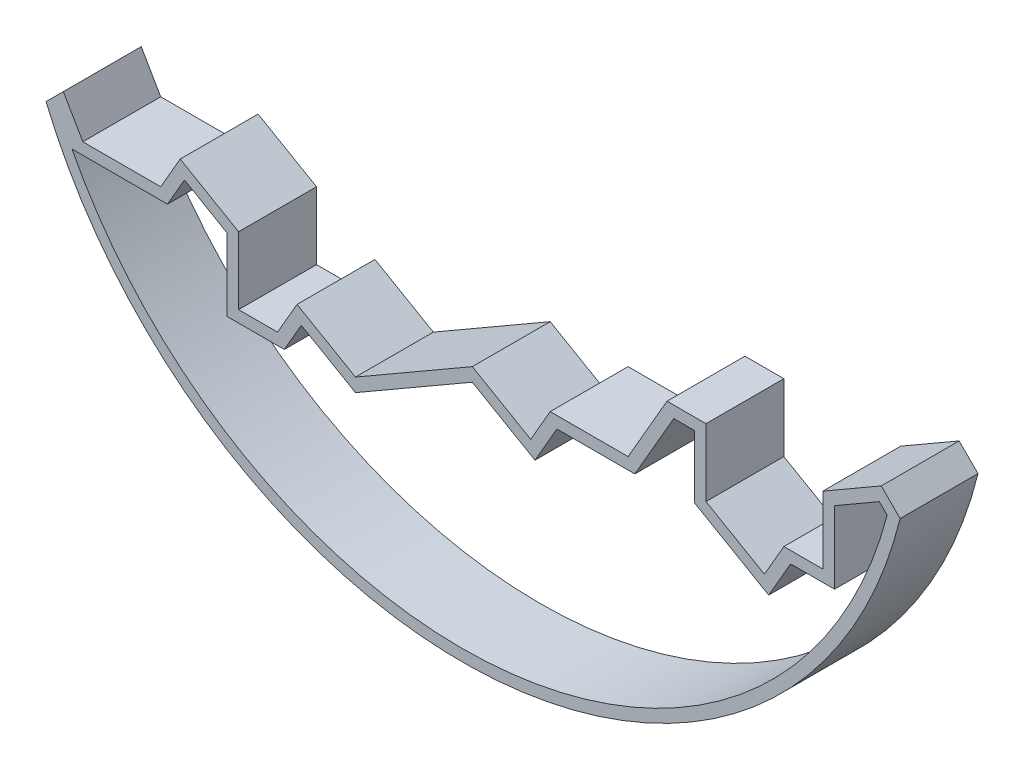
from build123d import *

# Parameters (mm, degrees)
P_IDAT_VYSUNUT_M1_DEPTH = 20


with BuildPart() as part:
    # Skica1 → P_idat vysunut_m1 (new body)
    with BuildSketch(Plane.XY):
        with BuildLine():
            Line((-181.460670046, 28.810119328), (-176.460670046, 20.14986529))
            Line((-176.460670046, 20.14986529), (-156.460670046, 20.14986529))
            Line((-156.460670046, 20.14986529), (-151.460670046, 28.810119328))
            Line((-151.460670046, 28.810119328), (-136.460670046, 20.14986529))
            Line((-136.460670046, 20.14986529), (-136.460670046, 2.829357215))
            Line((-136.460670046, 2.829357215), (-126.460670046, 2.829357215))
            Line((-126.460670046, 2.829357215), (-121.460670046, 11.489611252))
            Line((-121.460670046, 11.489611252), (-106.460670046, 2.829357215))
            Line((-106.460670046, 2.829357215), (-76.460670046, 20.14986529))
            Line((-76.460670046, 20.14986529), (-61.460670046, 11.489611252))
            Line((-61.460670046, 11.489611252), (-56.460670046, 20.14986529))
            Line((-56.460670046, 20.14986529), (-36.460670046, 20.14986529))
            Line((-36.460670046, 20.14986529), (-26.460670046, 37.470373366))
            Line((-26.460670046, 37.470373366), (-16.460670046, 37.470373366))
            Line((-16.460670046, 37.470373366), (-16.460670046, 20.14986529))
            Line((-16.460670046, 20.14986529), (-1.460670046, 11.489611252))
            Line((-1.460670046, 11.489611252), (3.539329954, 20.14986529))
            Line((3.539329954, 20.14986529), (13.539329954, 20.14986529))
            Line((13.539329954, 20.14986529), (13.539329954, 37.470373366))
            Line((13.539329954, 37.470373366), (28.539329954, 46.130627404))
            Line((28.539329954, 46.130627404), (33.382249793, 41.287707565))
            ThreePointArc((33.382249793, 41.287707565), (-70.144400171, -46.473745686), (-185.917059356, 24.353730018))
            Line((-185.917059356, 24.353730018), (-181.460670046, 28.810119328))
        make_face()
        with BuildLine():
            Line((-139.460670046, 18.417814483), (-139.460670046, -0.170642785))
            Line((-139.460670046, -0.170642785), (-124.728619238, -0.170642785))
            Line((-124.728619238, -0.170642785), (-120.362593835, 7.391535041))
            Line((-120.362593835, 7.391535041), (-106.460670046, -0.634744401))
            Line((-106.460670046, -0.634744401), (-76.460670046, 16.685763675))
            Line((-76.460670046, 16.685763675), (-60.362593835, 7.391535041))
            Line((-60.362593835, 7.391535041), (-54.728619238, 17.14986529))
            Line((-54.728619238, 17.14986529), (-34.728619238, 17.14986529))
            Line((-34.728619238, 17.14986529), (-24.728619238, 34.470373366))
            Line((-24.728619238, 34.470373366), (-19.460670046, 34.470373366))
            Line((-19.460670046, 34.470373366), (-19.460670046, 18.417814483))
            Line((-19.460670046, 18.417814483), (-0.362593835, 7.391535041))
            Line((-0.362593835, 7.391535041), (5.271380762, 17.14986529))
            Line((5.271380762, 17.14986529), (16.539329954, 17.14986529))
            Line((16.539329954, 17.14986529), (16.539329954, 35.738322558))
            Line((16.539329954, 35.738322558), (28.04575596, 42.381560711))
            Line((28.04575596, 42.381560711), (30.054300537, 40.373016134))
            ThreePointArc((30.054300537, 40.373016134), (-66.620262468, -43.129443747), (-179.248131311, 17.14986529))
            Line((-179.248131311, 17.14986529), (-154.728619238, 17.14986529))
            Line((-154.728619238, 17.14986529), (-150.362593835, 24.712043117))
            Line((-150.362593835, 24.712043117), (-139.460670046, 18.417814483))
        make_face(mode=Mode.SUBTRACT)
    extrude(amount=P_IDAT_VYSUNUT_M1_DEPTH)


solid = part.part
